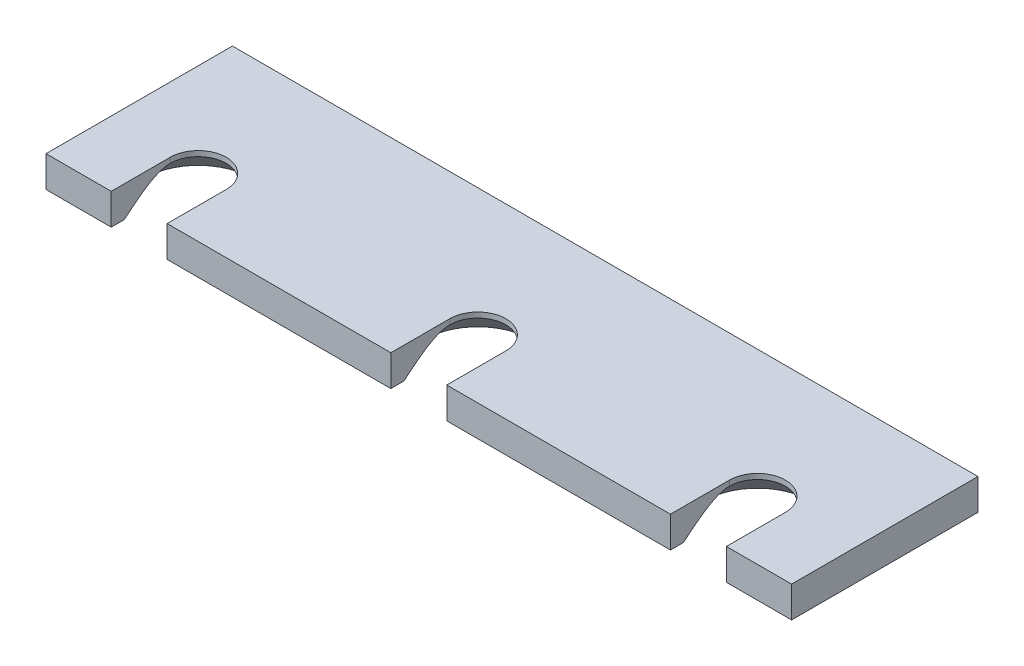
ISO-10303-21;
HEADER;
FILE_DESCRIPTION(('STEP AP214'),'2;1');
FILE_NAME('part.step','',(''),(''),'','','');
FILE_SCHEMA(('AUTOMOTIVE_DESIGN { 1 0 10303 214 1 1 1 1 }'));
ENDSEC;
DATA;
#1=APPLICATION_CONTEXT('core data for automotive mechanical design processes');
#2=APPLICATION_PROTOCOL_DEFINITION('international standard','automotive_design',2000,#1);
#3=PRODUCT_CONTEXT('',#1,'mechanical');
#4=PRODUCT('Part','Part','',(#3));
#5=PRODUCT_RELATED_PRODUCT_CATEGORY('part','',(#4));
#6=PRODUCT_DEFINITION_FORMATION('','',#4);
#7=PRODUCT_DEFINITION_CONTEXT('part definition',#1,'design');
#8=PRODUCT_DEFINITION('design','',#6,#7);
#9=PRODUCT_DEFINITION_SHAPE('','',#8);
#10=(LENGTH_UNIT() NAMED_UNIT(*) SI_UNIT(.MILLI.,.METRE.));
#11=(NAMED_UNIT(*) PLANE_ANGLE_UNIT() SI_UNIT($,.RADIAN.));
#12=(NAMED_UNIT(*) SI_UNIT($,.STERADIAN.) SOLID_ANGLE_UNIT());
#13=UNCERTAINTY_MEASURE_WITH_UNIT(LENGTH_MEASURE(1.E-05),#10,'distance_accuracy_value','');
#14=(GEOMETRIC_REPRESENTATION_CONTEXT(3) GLOBAL_UNCERTAINTY_ASSIGNED_CONTEXT((#13)) GLOBAL_UNIT_ASSIGNED_CONTEXT((#10,
#11,#12)) REPRESENTATION_CONTEXT('',''));
#15=CARTESIAN_POINT('',(0.,0.,0.));
#16=DIRECTION('',(0.,0.,1.));
#17=DIRECTION('',(1.,0.,0.));
#18=AXIS2_PLACEMENT_3D('',#15,#16,#17);
#19=CARTESIAN_POINT('',(60.,-5.00000000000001,15.));
#20=DIRECTION('',(0.,-1.,0.));
#21=DIRECTION('',(0.,0.,-1.));
#22=AXIS2_PLACEMENT_3D('',#19,#20,#21);
#23=PLANE('',#22);
#24=CARTESIAN_POINT('',(105.,-5.00000000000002,20.5));
#25=DIRECTION('',(0.,-1.,0.));
#26=DIRECTION('',(0.,0.,-1.));
#27=AXIS2_PLACEMENT_3D('',#24,#25,#26);
#28=CIRCLE('',#27,8.65000000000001);
#29=CARTESIAN_POINT('',(100.5,-5.00000000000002,27.8873202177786));
#30=VERTEX_POINT('',#29);
#31=CARTESIAN_POINT('',(109.5,-5.00000000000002,27.8873202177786));
#32=VERTEX_POINT('',#31);
#33=EDGE_CURVE('E165',#30,#32,#28,.T.);
#34=ORIENTED_EDGE('',*,*,#33,.F.);
#35=DIRECTION('',(0.,0.,-1.));
#36=VECTOR('',#35,1.);
#37=CARTESIAN_POINT('',(100.5,-5.00000000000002,25.25));
#38=LINE('',#37,#36);
#39=CARTESIAN_POINT('',(100.5,-5.00000000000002,30.));
#40=VERTEX_POINT('',#39);
#41=EDGE_CURVE('E339',#40,#30,#38,.T.);
#42=ORIENTED_EDGE('',*,*,#41,.F.);
#43=DIRECTION('',(-1.,0.,0.));
#44=VECTOR('',#43,1.);
#45=CARTESIAN_POINT('',(60.,-5.00000000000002,30.));
#46=LINE('',#45,#44);
#47=CARTESIAN_POINT('',(64.5,-5.00000000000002,30.));
#48=VERTEX_POINT('',#47);
#49=EDGE_CURVE('E262',#40,#48,#46,.T.);
#50=ORIENTED_EDGE('',*,*,#49,.T.);
#51=DIRECTION('',(0.,0.,1.));
#52=VECTOR('',#51,1.);
#53=CARTESIAN_POINT('',(64.5,-5.00000000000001,25.25));
#54=LINE('',#53,#52);
#55=CARTESIAN_POINT('',(64.5,-5.00000000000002,27.8873202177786));
#56=VERTEX_POINT('',#55);
#57=EDGE_CURVE('E260',#56,#48,#54,.T.);
#58=ORIENTED_EDGE('',*,*,#57,.F.);
#59=CARTESIAN_POINT('',(60.,-5.00000000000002,20.5));
#60=DIRECTION('',(0.,-1.,0.));
#61=DIRECTION('',(0.,0.,-1.));
#62=AXIS2_PLACEMENT_3D('',#59,#60,#61);
#63=CIRCLE('',#62,8.65000000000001);
#64=CARTESIAN_POINT('',(55.5,-5.00000000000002,27.8873202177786));
#65=VERTEX_POINT('',#64);
#66=EDGE_CURVE('E169',#65,#56,#63,.T.);
#67=ORIENTED_EDGE('',*,*,#66,.F.);
#68=DIRECTION('',(0.,0.,-1.));
#69=VECTOR('',#68,1.);
#70=CARTESIAN_POINT('',(55.5,-5.00000000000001,25.25));
#71=LINE('',#70,#69);
#72=CARTESIAN_POINT('',(55.5,-5.00000000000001,30.));
#73=VERTEX_POINT('',#72);
#74=EDGE_CURVE('E251',#73,#65,#71,.T.);
#75=ORIENTED_EDGE('',*,*,#74,.F.);
#76=DIRECTION('',(-1.,0.,0.));
#77=VECTOR('',#76,1.);
#78=CARTESIAN_POINT('',(60.,-5.00000000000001,30.));
#79=LINE('',#78,#77);
#80=CARTESIAN_POINT('',(19.5,-5.00000000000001,30.));
#81=VERTEX_POINT('',#80);
#82=EDGE_CURVE('E250',#73,#81,#79,.T.);
#83=ORIENTED_EDGE('',*,*,#82,.T.);
#84=DIRECTION('',(0.,0.,1.));
#85=VECTOR('',#84,1.);
#86=CARTESIAN_POINT('',(19.5,-5.00000000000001,25.25));
#87=LINE('',#86,#85);
#88=CARTESIAN_POINT('',(19.5,-5.00000000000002,27.8873202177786));
#89=VERTEX_POINT('',#88);
#90=EDGE_CURVE('E239',#89,#81,#87,.T.);
#91=ORIENTED_EDGE('',*,*,#90,.F.);
#92=CARTESIAN_POINT('',(15.,-5.00000000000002,20.5));
#93=DIRECTION('',(0.,-1.,0.));
#94=DIRECTION('',(0.,0.,-1.));
#95=AXIS2_PLACEMENT_3D('',#92,#93,#94);
#96=CIRCLE('',#95,8.65);
#97=CARTESIAN_POINT('',(10.5,-5.00000000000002,27.8873202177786));
#98=VERTEX_POINT('',#97);
#99=EDGE_CURVE('E375',#98,#89,#96,.T.);
#100=ORIENTED_EDGE('',*,*,#99,.F.);
#101=DIRECTION('',(0.,0.,-1.));
#102=VECTOR('',#101,1.);
#103=CARTESIAN_POINT('',(10.5,-5.,25.25));
#104=LINE('',#103,#102);
#105=CARTESIAN_POINT('',(10.5,-5.,30.));
#106=VERTEX_POINT('',#105);
#107=EDGE_CURVE('E230',#106,#98,#104,.T.);
#108=ORIENTED_EDGE('',*,*,#107,.F.);
#109=DIRECTION('',(-1.,0.,0.));
#110=VECTOR('',#109,1.);
#111=CARTESIAN_POINT('',(60.,-5.,30.));
#112=LINE('',#111,#110);
#113=CARTESIAN_POINT('',(0.,-5.,30.));
#114=VERTEX_POINT('',#113);
#115=EDGE_CURVE('E229',#106,#114,#112,.T.);
#116=ORIENTED_EDGE('',*,*,#115,.T.);
#117=DIRECTION('',(0.,0.,-1.));
#118=VECTOR('',#117,1.);
#119=CARTESIAN_POINT('',(0.,-5.,15.));
#120=LINE('',#119,#118);
#121=CARTESIAN_POINT('',(0.,-5.,0.));
#122=VERTEX_POINT('',#121);
#123=EDGE_CURVE('E222',#114,#122,#120,.T.);
#124=ORIENTED_EDGE('',*,*,#123,.T.);
#125=DIRECTION('',(1.,0.,0.));
#126=VECTOR('',#125,1.);
#127=CARTESIAN_POINT('',(60.,-5.,0.));
#128=LINE('',#127,#126);
#129=CARTESIAN_POINT('',(120.,-5.00000000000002,0.));
#130=VERTEX_POINT('',#129);
#131=EDGE_CURVE('E215',#122,#130,#128,.T.);
#132=ORIENTED_EDGE('',*,*,#131,.T.);
#133=DIRECTION('',(0.,0.,1.));
#134=VECTOR('',#133,1.);
#135=CARTESIAN_POINT('',(120.,-5.00000000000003,15.));
#136=LINE('',#135,#134);
#137=CARTESIAN_POINT('',(120.,-5.00000000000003,30.));
#138=VERTEX_POINT('',#137);
#139=EDGE_CURVE('E208',#130,#138,#136,.T.);
#140=ORIENTED_EDGE('',*,*,#139,.T.);
#141=DIRECTION('',(-1.,0.,0.));
#142=VECTOR('',#141,1.);
#143=CARTESIAN_POINT('',(60.,-5.00000000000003,30.));
#144=LINE('',#143,#142);
#145=CARTESIAN_POINT('',(109.5,-5.00000000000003,30.));
#146=VERTEX_POINT('',#145);
#147=EDGE_CURVE('E193',#138,#146,#144,.T.);
#148=ORIENTED_EDGE('',*,*,#147,.T.);
#149=DIRECTION('',(0.,0.,1.));
#150=VECTOR('',#149,1.);
#151=CARTESIAN_POINT('',(109.5,-5.00000000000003,25.25));
#152=LINE('',#151,#150);
#153=EDGE_CURVE('E187',#32,#146,#152,.T.);
#154=ORIENTED_EDGE('',*,*,#153,.F.);
#155=EDGE_LOOP('',(#34,#42,#50,#58,#67,#75,#83,#91,#100,#108,#116,#124,#132,#140,#148,#154));
#156=FACE_BOUND('',#155,.T.);
#157=ADVANCED_FACE('F30',(#156),#23,.T.);
#158=CARTESIAN_POINT('',(60.,-2.50000000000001,30.));
#159=DIRECTION('',(0.,0.,-1.));
#160=DIRECTION('',(-1.,0.,0.));
#161=AXIS2_PLACEMENT_3D('',#158,#159,#160);
#162=PLANE('',#161);
#163=DIRECTION('',(1.,0.,0.));
#164=VECTOR('',#163,1.);
#165=CARTESIAN_POINT('',(60.,0.,30.));
#166=LINE('',#165,#164);
#167=CARTESIAN_POINT('',(100.5,0.,30.));
#168=VERTEX_POINT('',#167);
#169=CARTESIAN_POINT('',(64.5,0.,30.));
#170=VERTEX_POINT('',#169);
#171=EDGE_CURVE('E191',#168,#170,#166,.F.);
#172=ORIENTED_EDGE('',*,*,#171,.T.);
#173=DIRECTION('',(0.,1.,0.));
#174=VECTOR('',#173,1.);
#175=CARTESIAN_POINT('',(64.5,-2.50000000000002,30.));
#176=LINE('',#175,#174);
#177=EDGE_CURVE('E259',#48,#170,#176,.T.);
#178=ORIENTED_EDGE('',*,*,#177,.F.);
#179=ORIENTED_EDGE('',*,*,#49,.F.);
#180=DIRECTION('',(0.,1.,0.));
#181=VECTOR('',#180,1.);
#182=CARTESIAN_POINT('',(100.5,-2.50000000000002,30.));
#183=LINE('',#182,#181);
#184=EDGE_CURVE('E185',#168,#40,#183,.F.);
#185=ORIENTED_EDGE('',*,*,#184,.F.);
#186=EDGE_LOOP('',(#172,#178,#179,#185));
#187=FACE_BOUND('',#186,.T.);
#188=ADVANCED_FACE('F381',(#187),#162,.F.);
#189=CARTESIAN_POINT('',(64.5,-2.50000000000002,25.25));
#190=DIRECTION('',(-1.,0.,0.));
#191=DIRECTION('',(0.,0.,1.));
#192=AXIS2_PLACEMENT_3D('',#189,#190,#191);
#193=PLANE('',#192);
#194=CARTESIAN_POINT('',(64.5,-9.28963943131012,32.631952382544));
#195=CARTESIAN_POINT('',(64.5,-9.02914938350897,32.3540918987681));
#196=CARTESIAN_POINT('',(64.5,-8.76920684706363,32.0757150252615));
#197=CARTESIAN_POINT('',(64.5,-8.25072788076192,31.5176296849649));
#198=CARTESIAN_POINT('',(64.5,-7.99219152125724,31.2379211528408));
#199=CARTESIAN_POINT('',(64.5,-7.47619973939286,30.6761803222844));
#200=CARTESIAN_POINT('',(64.5,-7.21874880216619,30.3941438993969));
#201=CARTESIAN_POINT('',(64.5,-6.7060771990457,29.8280630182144));
#202=CARTESIAN_POINT('',(64.5,-6.45085647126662,29.5440186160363));
#203=CARTESIAN_POINT('',(64.5,-5.91705178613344,28.9438858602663));
#204=CARTESIAN_POINT('',(64.5,-5.63877948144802,28.6275198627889));
#205=CARTESIAN_POINT('',(64.5,-5.08698000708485,27.9906748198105));
#206=CARTESIAN_POINT('',(64.5,-4.81345268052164,27.6701959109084));
#207=CARTESIAN_POINT('',(64.5,-4.40838766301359,27.1854620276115));
#208=CARTESIAN_POINT('',(64.5,-4.27432144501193,27.0233202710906));
#209=CARTESIAN_POINT('',(64.5,-4.00823214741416,26.6973706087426));
#210=CARTESIAN_POINT('',(64.5,-3.87620903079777,26.5335627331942));
#211=CARTESIAN_POINT('',(64.5,-3.61467406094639,26.2039933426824));
#212=CARTESIAN_POINT('',(64.5,-3.48516181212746,26.0382321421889));
#213=CARTESIAN_POINT('',(64.5,-3.22922450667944,25.7043478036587));
#214=CARTESIAN_POINT('',(64.5,-3.10279930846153,25.5362247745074));
#215=CARTESIAN_POINT('',(64.5,-2.87610002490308,25.2274628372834));
#216=CARTESIAN_POINT('',(64.5,-2.77519419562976,25.0872885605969));
#217=CARTESIAN_POINT('',(64.5,-2.5765730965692,24.8046862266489));
#218=CARTESIAN_POINT('',(64.5,-2.4788578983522,24.662258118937));
#219=CARTESIAN_POINT('',(64.5,-2.28720730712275,24.3745279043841));
#220=CARTESIAN_POINT('',(64.5,-2.19327845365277,24.2292214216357));
#221=CARTESIAN_POINT('',(64.5,-2.0103594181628,23.9355314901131));
#222=CARTESIAN_POINT('',(64.5,-1.92136904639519,23.7871481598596));
#223=CARTESIAN_POINT('',(64.5,-1.75146036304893,23.4900321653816));
#224=CARTESIAN_POINT('',(64.5,-1.67040896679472,23.3413766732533));
#225=CARTESIAN_POINT('',(64.5,-1.51584704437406,23.040218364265));
#226=CARTESIAN_POINT('',(64.5,-1.44233810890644,22.8877147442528));
#227=CARTESIAN_POINT('',(64.5,-1.23649826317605,22.4245930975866));
#228=CARTESIAN_POINT('',(64.5,-1.11813722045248,22.107171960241));
#229=CARTESIAN_POINT('',(64.5,-0.998404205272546,21.6701337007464));
#230=CARTESIAN_POINT('',(64.5,-0.971238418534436,21.5574461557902));
#231=CARTESIAN_POINT('',(64.5,-0.924637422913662,21.3304448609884));
#232=CARTESIAN_POINT('',(64.5,-0.905202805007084,21.2161309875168));
#233=CARTESIAN_POINT('',(64.5,-0.874820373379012,20.9867077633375));
#234=CARTESIAN_POINT('',(64.5,-0.863848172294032,20.871601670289));
#235=CARTESIAN_POINT('',(64.5,-0.850731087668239,20.6408817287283));
#236=CARTESIAN_POINT('',(64.5,-0.848586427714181,20.5252678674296));
#237=CARTESIAN_POINT('',(64.5,-0.853614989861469,20.2747214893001));
#238=CARTESIAN_POINT('',(64.5,-0.862420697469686,20.1398193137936));
#239=CARTESIAN_POINT('',(64.5,-0.891744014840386,19.8712931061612));
#240=CARTESIAN_POINT('',(64.5,-0.912263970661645,19.7376693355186));
#241=CARTESIAN_POINT('',(64.5,-0.96427172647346,19.4710155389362));
#242=CARTESIAN_POINT('',(64.5,-0.995882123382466,19.3380097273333));
#243=CARTESIAN_POINT('',(64.5,-1.06863152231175,19.0746913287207));
#244=CARTESIAN_POINT('',(64.5,-1.10976885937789,18.9443782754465));
#245=CARTESIAN_POINT('',(64.5,-1.20814173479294,18.6637689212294));
#246=CARTESIAN_POINT('',(64.5,-1.26693818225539,18.5140236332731));
#247=CARTESIAN_POINT('',(64.5,-1.39360059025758,18.218385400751));
#248=CARTESIAN_POINT('',(64.5,-1.46147087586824,18.0724943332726));
#249=CARTESIAN_POINT('',(64.5,-1.60468406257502,17.78385245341));
#250=CARTESIAN_POINT('',(64.5,-1.6800509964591,17.6411136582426));
#251=CARTESIAN_POINT('',(64.5,-1.83659102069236,17.3589076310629));
#252=CARTESIAN_POINT('',(64.5,-1.91776317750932,17.2194398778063));
#253=CARTESIAN_POINT('',(64.5,-2.08118110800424,16.9492963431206));
#254=CARTESIAN_POINT('',(64.5,-2.16322979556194,16.8185007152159));
#255=CARTESIAN_POINT('',(64.5,-2.33083360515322,16.5591681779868));
#256=CARTESIAN_POINT('',(64.5,-2.41638900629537,16.4306314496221));
#257=CARTESIAN_POINT('',(64.5,-2.58966592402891,16.176574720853));
#258=CARTESIAN_POINT('',(64.5,-2.67736393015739,16.0510386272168));
#259=CARTESIAN_POINT('',(64.5,-2.85511340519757,15.8016954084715));
#260=CARTESIAN_POINT('',(64.5,-2.94516420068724,15.6778878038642));
#261=CARTESIAN_POINT('',(64.5,-3.0361769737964,15.5548040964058));
#262=B_SPLINE_CURVE_WITH_KNOTS('',3,(#194,#195,#196,#197,#198,#199,#200,#201,#202,#203,#204,
#205,#206,#207,#208,#209,#210,#211,#212,#213,#214,#215,#216,#217,#218,#219,#220,#221,#222,#223,
#224,#225,#226,#227,#228,#229,#230,#231,#232,#233,#234,#235,#236,#237,#238,#239,#240,#241,#242,
#243,#244,#245,#246,#247,#248,#249,#250,#251,#252,#253,#254,#255,#256,#257,#258,#259,#260,#261),
.UNSPECIFIED.,.F.,.F.,(4,2,2,2,2,2,2,2,2,2,2,2,2,2,2,2,2,2,2,2,2,2,2,2,2,2,2,2,2,2,2,2,2,4),(0.,
1.14261090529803,2.28527845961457,3.43088244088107,4.57645453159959,5.84042824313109,
7.10436008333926,7.7355155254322,8.36665951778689,8.99770325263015,9.62871798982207,
10.1468301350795,10.6649538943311,11.1839372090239,11.7029005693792,12.2106238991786,
12.718454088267,13.7299570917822,14.0774921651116,14.4250537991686,14.7716100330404,
15.1181750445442,15.523189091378,15.928284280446,16.3380064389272,16.7476570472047,
17.229901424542,17.7123764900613,18.1964514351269,18.6804487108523,19.1435840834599,
19.6067563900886,20.0661312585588,20.5253760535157),.UNSPECIFIED.);
#263=CARTESIAN_POINT('',(64.5,-0.850000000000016,20.5));
#264=VERTEX_POINT('',#263);
#265=EDGE_CURVE('E370',#56,#264,#262,.T.);
#266=ORIENTED_EDGE('',*,*,#265,.F.);
#267=ORIENTED_EDGE('',*,*,#57,.T.);
#268=ORIENTED_EDGE('',*,*,#177,.T.);
#269=DIRECTION('',(0.,0.,-1.));
#270=VECTOR('',#269,1.);
#271=CARTESIAN_POINT('',(64.5,0.,15.));
#272=LINE('',#271,#270);
#273=CARTESIAN_POINT('',(64.5,0.,20.5));
#274=VERTEX_POINT('',#273);
#275=EDGE_CURVE('E287',#170,#274,#272,.T.);
#276=ORIENTED_EDGE('',*,*,#275,.T.);
#277=DIRECTION('',(0.,-1.,0.));
#278=VECTOR('',#277,1.);
#279=CARTESIAN_POINT('',(64.5,-2.50000000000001,20.5));
#280=LINE('',#279,#278);
#281=EDGE_CURVE('E256',#274,#264,#280,.T.);
#282=ORIENTED_EDGE('',*,*,#281,.T.);
#283=EDGE_LOOP('',(#266,#267,#268,#276,#282));
#284=FACE_BOUND('',#283,.T.);
#285=ADVANCED_FACE('F376',(#284),#193,.T.);
#286=CARTESIAN_POINT('',(60.,-2.50000000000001,20.5));
#287=DIRECTION('',(0.,-1.,0.));
#288=DIRECTION('',(1.,0.,0.));
#289=AXIS2_PLACEMENT_3D('',#286,#287,#288);
#290=CYLINDRICAL_SURFACE('',#289,4.5);
#291=DIRECTION('',(0.,1.,0.));
#292=VECTOR('',#291,1.);
#293=CARTESIAN_POINT('',(55.5,-2.50000000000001,20.5));
#294=LINE('',#293,#292);
#295=CARTESIAN_POINT('',(55.5,-0.850000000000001,20.5));
#296=VERTEX_POINT('',#295);
#297=CARTESIAN_POINT('',(55.5,0.,20.5));
#298=VERTEX_POINT('',#297);
#299=EDGE_CURVE('E254',#296,#298,#294,.T.);
#300=ORIENTED_EDGE('',*,*,#299,.F.);
#301=CARTESIAN_POINT('',(60.,-0.850000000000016,20.5));
#302=DIRECTION('',(0.,-1.,0.));
#303=DIRECTION('',(0.,0.,-1.));
#304=AXIS2_PLACEMENT_3D('',#301,#302,#303);
#305=CIRCLE('',#304,4.5);
#306=EDGE_CURVE('E56',#296,#264,#305,.T.);
#307=ORIENTED_EDGE('',*,*,#306,.T.);
#308=ORIENTED_EDGE('',*,*,#281,.F.);
#309=CARTESIAN_POINT('',(60.,0.,20.5));
#310=DIRECTION('',(0.,-1.,0.));
#311=DIRECTION('',(1.,0.,0.));
#312=AXIS2_PLACEMENT_3D('',#309,#310,#311);
#313=CIRCLE('',#312,4.5);
#314=EDGE_CURVE('E284',#274,#298,#313,.F.);
#315=ORIENTED_EDGE('',*,*,#314,.T.);
#316=EDGE_LOOP('',(#300,#307,#308,#315));
#317=FACE_BOUND('',#316,.T.);
#318=ADVANCED_FACE('F380',(#317),#290,.F.);
#319=CARTESIAN_POINT('',(55.5,-2.50000000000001,25.25));
#320=DIRECTION('',(1.,0.,0.));
#321=DIRECTION('',(0.,0.,-1.));
#322=AXIS2_PLACEMENT_3D('',#319,#320,#321);
#323=PLANE('',#322);
#324=CARTESIAN_POINT('',(55.5,-9.28963943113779,32.6319523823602));
#325=CARTESIAN_POINT('',(55.5,-9.0291493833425,32.35409189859));
#326=CARTESIAN_POINT('',(55.5,-8.76920684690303,32.0757150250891));
#327=CARTESIAN_POINT('',(55.5,-8.25072788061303,31.5176296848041));
#328=CARTESIAN_POINT('',(55.5,-7.99219152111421,31.2379211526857));
#329=CARTESIAN_POINT('',(55.5,-7.47619973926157,30.6761803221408));
#330=CARTESIAN_POINT('',(55.5,-7.21874880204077,30.3941438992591));
#331=CARTESIAN_POINT('',(55.5,-6.70607719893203,29.8280630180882));
#332=CARTESIAN_POINT('',(55.5,-6.45085647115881,29.5440186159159));
#333=CARTESIAN_POINT('',(55.5,-5.91705178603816,28.9438858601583));
#334=CARTESIAN_POINT('',(55.5,-5.6387794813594,28.6275198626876));
#335=CARTESIAN_POINT('',(55.5,-5.08698000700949,27.9906748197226));
#336=CARTESIAN_POINT('',(55.5,-4.81345268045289,27.6701959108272));
#337=CARTESIAN_POINT('',(55.5,-4.40838766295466,27.1854620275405));
#338=CARTESIAN_POINT('',(55.5,-4.27432144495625,27.023320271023));
#339=CARTESIAN_POINT('',(55.5,-4.00823214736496,26.6973706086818));
#340=CARTESIAN_POINT('',(55.5,-3.87620903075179,26.5335627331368));
#341=CARTESIAN_POINT('',(55.5,-3.61467406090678,26.203993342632));
#342=CARTESIAN_POINT('',(55.5,-3.48516181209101,26.038232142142));
#343=CARTESIAN_POINT('',(55.5,-3.22922450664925,25.7043478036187));
#344=CARTESIAN_POINT('',(55.5,-3.10279930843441,25.536224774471));
#345=CARTESIAN_POINT('',(55.5,-2.87610002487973,25.2274628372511));
#346=CARTESIAN_POINT('',(55.5,-2.77519419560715,25.0872885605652));
#347=CARTESIAN_POINT('',(55.5,-2.57657309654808,24.8046862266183));
#348=CARTESIAN_POINT('',(55.5,-2.47885789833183,24.662258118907));
#349=CARTESIAN_POINT('',(55.5,-2.28720730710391,24.3745279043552));
#350=CARTESIAN_POINT('',(55.5,-2.19327845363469,24.2292214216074));
#351=CARTESIAN_POINT('',(55.5,-2.01035941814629,23.9355314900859));
#352=CARTESIAN_POINT('',(55.5,-1.92136904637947,23.787148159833));
#353=CARTESIAN_POINT('',(55.5,-1.75146036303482,23.4900321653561));
#354=CARTESIAN_POINT('',(55.5,-1.67040896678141,23.3413766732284));
#355=CARTESIAN_POINT('',(55.5,-1.51584704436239,23.0402183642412));
#356=CARTESIAN_POINT('',(55.5,-1.44233810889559,22.8877147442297));
#357=CARTESIAN_POINT('',(55.5,-1.23649826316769,22.4245930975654));
#358=CARTESIAN_POINT('',(55.5,-1.11813722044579,22.107171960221));
#359=CARTESIAN_POINT('',(55.5,-0.998404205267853,21.6701337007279));
#360=CARTESIAN_POINT('',(55.5,-0.971238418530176,21.5574461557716));
#361=CARTESIAN_POINT('',(55.5,-0.924637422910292,21.33044486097));
#362=CARTESIAN_POINT('',(55.5,-0.905202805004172,21.2161309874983));
#363=CARTESIAN_POINT('',(55.5,-0.874820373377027,20.9867077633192));
#364=CARTESIAN_POINT('',(55.5,-0.863848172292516,20.8716016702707));
#365=CARTESIAN_POINT('',(55.5,-0.85073108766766,20.6408817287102));
#366=CARTESIAN_POINT('',(55.5,-0.848586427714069,20.5252678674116));
#367=CARTESIAN_POINT('',(55.5,-0.853614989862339,20.2747214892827));
#368=CARTESIAN_POINT('',(55.5,-0.86242069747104,20.1398193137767));
#369=CARTESIAN_POINT('',(55.5,-0.891744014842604,19.8712931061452));
#370=CARTESIAN_POINT('',(55.5,-0.912263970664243,19.7376693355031));
#371=CARTESIAN_POINT('',(55.5,-0.964271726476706,19.4710155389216));
#372=CARTESIAN_POINT('',(55.5,-0.995882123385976,19.3380097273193));
#373=CARTESIAN_POINT('',(55.5,-1.06863152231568,19.0746913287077));
#374=CARTESIAN_POINT('',(55.5,-1.10976885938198,18.944378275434));
#375=CARTESIAN_POINT('',(55.5,-1.20814173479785,18.6637689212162));
#376=CARTESIAN_POINT('',(55.5,-1.26693818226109,18.5140236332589));
#377=CARTESIAN_POINT('',(55.5,-1.39360059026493,18.2183854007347));
#378=CARTESIAN_POINT('',(55.5,-1.46147087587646,18.0724943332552));
#379=CARTESIAN_POINT('',(55.5,-1.60468406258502,17.7838524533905));
#380=CARTESIAN_POINT('',(55.5,-1.68005099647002,17.6411136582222));
#381=CARTESIAN_POINT('',(55.5,-1.83659102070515,17.3589076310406));
#382=CARTESIAN_POINT('',(55.5,-1.91776317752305,17.2194398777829));
#383=CARTESIAN_POINT('',(55.5,-2.08118110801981,16.9492963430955));
#384=CARTESIAN_POINT('',(55.5,-2.16322979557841,16.8185007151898));
#385=CARTESIAN_POINT('',(55.5,-2.33083360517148,16.5591681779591));
#386=CARTESIAN_POINT('',(55.5,-2.41638900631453,16.4306314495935));
#387=CARTESIAN_POINT('',(55.5,-2.58966592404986,16.1765747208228));
#388=CARTESIAN_POINT('',(55.5,-2.67736393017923,16.0510386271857));
#389=CARTESIAN_POINT('',(55.5,-2.85511340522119,15.8016954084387));
#390=CARTESIAN_POINT('',(55.5,-2.94516420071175,15.6778878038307));
#391=CARTESIAN_POINT('',(55.5,-3.0361769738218,15.5548040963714));
#392=B_SPLINE_CURVE_WITH_KNOTS('',3,(#324,#325,#326,#327,#328,#329,#330,#331,#332,#333,#334,
#335,#336,#337,#338,#339,#340,#341,#342,#343,#344,#345,#346,#347,#348,#349,#350,#351,#352,#353,
#354,#355,#356,#357,#358,#359,#360,#361,#362,#363,#364,#365,#366,#367,#368,#369,#370,#371,#372,
#373,#374,#375,#376,#377,#378,#379,#380,#381,#382,#383,#384,#385,#386,#387,#388,#389,#390,#391),
.UNSPECIFIED.,.F.,.F.,(4,2,2,2,2,2,2,2,2,2,2,2,2,2,2,2,2,2,2,2,2,2,2,2,2,2,2,2,2,2,2,2,2,4),(0.,
1.14261090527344,2.28527845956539,3.43088244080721,4.57645453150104,5.84042824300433,
7.1043600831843,7.73551552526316,8.36665951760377,8.99770325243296,9.62871798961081,
10.1468301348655,10.6649538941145,11.1839372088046,11.7029005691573,12.2106238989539,
12.7184540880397,13.7299570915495,14.0774921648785,14.4250537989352,14.7716100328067,
15.1181750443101,15.5231890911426,15.9282842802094,16.3380064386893,16.7476570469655,
17.2299014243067,17.7123764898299,18.1964514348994,18.6804487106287,19.14358408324,
19.6067563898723,20.066131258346,20.5253760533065),.UNSPECIFIED.);
#393=EDGE_CURVE('E42',#296,#65,#392,.F.);
#394=ORIENTED_EDGE('',*,*,#393,.F.);
#395=ORIENTED_EDGE('',*,*,#299,.T.);
#396=DIRECTION('',(0.,0.,-1.));
#397=VECTOR('',#396,1.);
#398=CARTESIAN_POINT('',(55.5,0.,15.));
#399=LINE('',#398,#397);
#400=CARTESIAN_POINT('',(55.5,0.,30.));
#401=VERTEX_POINT('',#400);
#402=EDGE_CURVE('E247',#298,#401,#399,.F.);
#403=ORIENTED_EDGE('',*,*,#402,.T.);
#404=DIRECTION('',(0.,1.,0.));
#405=VECTOR('',#404,1.);
#406=CARTESIAN_POINT('',(55.5,-2.50000000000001,30.));
#407=LINE('',#406,#405);
#408=EDGE_CURVE('E241',#401,#73,#407,.F.);
#409=ORIENTED_EDGE('',*,*,#408,.T.);
#410=ORIENTED_EDGE('',*,*,#74,.T.);
#411=EDGE_LOOP('',(#394,#395,#403,#409,#410));
#412=FACE_BOUND('',#411,.T.);
#413=ADVANCED_FACE('F442',(#412),#323,.T.);
#414=CARTESIAN_POINT('',(60.,-2.50000000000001,30.));
#415=DIRECTION('',(0.,0.,-1.));
#416=DIRECTION('',(-1.,0.,0.));
#417=AXIS2_PLACEMENT_3D('',#414,#415,#416);
#418=PLANE('',#417);
#419=DIRECTION('',(1.,0.,0.));
#420=VECTOR('',#419,1.);
#421=CARTESIAN_POINT('',(60.,0.,30.));
#422=LINE('',#421,#420);
#423=CARTESIAN_POINT('',(19.5,0.,30.));
#424=VERTEX_POINT('',#423);
#425=EDGE_CURVE('E243',#401,#424,#422,.F.);
#426=ORIENTED_EDGE('',*,*,#425,.T.);
#427=DIRECTION('',(0.,1.,0.));
#428=VECTOR('',#427,1.);
#429=CARTESIAN_POINT('',(19.5,-2.5,30.));
#430=LINE('',#429,#428);
#431=EDGE_CURVE('E238',#81,#424,#430,.T.);
#432=ORIENTED_EDGE('',*,*,#431,.F.);
#433=ORIENTED_EDGE('',*,*,#82,.F.);
#434=ORIENTED_EDGE('',*,*,#408,.F.);
#435=EDGE_LOOP('',(#426,#432,#433,#434));
#436=FACE_BOUND('',#435,.T.);
#437=ADVANCED_FACE('F318',(#436),#418,.F.);
#438=CARTESIAN_POINT('',(19.5,-2.5,25.25));
#439=DIRECTION('',(-1.,0.,0.));
#440=DIRECTION('',(0.,0.,1.));
#441=AXIS2_PLACEMENT_3D('',#438,#439,#440);
#442=PLANE('',#441);
#443=CARTESIAN_POINT('',(19.5,-9.28963943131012,32.631952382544));
#444=CARTESIAN_POINT('',(19.5,-9.02914938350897,32.3540918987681));
#445=CARTESIAN_POINT('',(19.5,-8.76920684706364,32.0757150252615));
#446=CARTESIAN_POINT('',(19.5,-8.25072788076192,31.5176296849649));
#447=CARTESIAN_POINT('',(19.5,-7.99219152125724,31.2379211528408));
#448=CARTESIAN_POINT('',(19.5,-7.47619973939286,30.6761803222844));
#449=CARTESIAN_POINT('',(19.5,-7.21874880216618,30.3941438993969));
#450=CARTESIAN_POINT('',(19.5,-6.7060771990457,29.8280630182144));
#451=CARTESIAN_POINT('',(19.5,-6.45085647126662,29.5440186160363));
#452=CARTESIAN_POINT('',(19.5,-5.91705178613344,28.9438858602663));
#453=CARTESIAN_POINT('',(19.5,-5.63877948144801,28.6275198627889));
#454=CARTESIAN_POINT('',(19.5,-5.08698000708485,27.9906748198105));
#455=CARTESIAN_POINT('',(19.5,-4.81345268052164,27.6701959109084));
#456=CARTESIAN_POINT('',(19.5,-4.40838766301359,27.1854620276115));
#457=CARTESIAN_POINT('',(19.5,-4.27432144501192,27.0233202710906));
#458=CARTESIAN_POINT('',(19.5,-4.00823214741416,26.6973706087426));
#459=CARTESIAN_POINT('',(19.5,-3.87620903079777,26.5335627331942));
#460=CARTESIAN_POINT('',(19.5,-3.61467406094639,26.2039933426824));
#461=CARTESIAN_POINT('',(19.5,-3.48516181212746,26.0382321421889));
#462=CARTESIAN_POINT('',(19.5,-3.22922450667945,25.7043478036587));
#463=CARTESIAN_POINT('',(19.5,-3.10279930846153,25.5362247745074));
#464=CARTESIAN_POINT('',(19.5,-2.87610002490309,25.2274628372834));
#465=CARTESIAN_POINT('',(19.5,-2.77519419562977,25.0872885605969));
#466=CARTESIAN_POINT('',(19.5,-2.57657309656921,24.8046862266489));
#467=CARTESIAN_POINT('',(19.5,-2.4788578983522,24.662258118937));
#468=CARTESIAN_POINT('',(19.5,-2.28720730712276,24.3745279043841));
#469=CARTESIAN_POINT('',(19.5,-2.19327845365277,24.2292214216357));
#470=CARTESIAN_POINT('',(19.5,-2.0103594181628,23.9355314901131));
#471=CARTESIAN_POINT('',(19.5,-1.92136904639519,23.7871481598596));
#472=CARTESIAN_POINT('',(19.5,-1.75146036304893,23.4900321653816));
#473=CARTESIAN_POINT('',(19.5,-1.67040896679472,23.3413766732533));
#474=CARTESIAN_POINT('',(19.5,-1.51584704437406,23.040218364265));
#475=CARTESIAN_POINT('',(19.5,-1.44233810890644,22.8877147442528));
#476=CARTESIAN_POINT('',(19.5,-1.23649826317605,22.4245930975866));
#477=CARTESIAN_POINT('',(19.5,-1.11813722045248,22.107171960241));
#478=CARTESIAN_POINT('',(19.5,-0.998404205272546,21.6701337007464));
#479=CARTESIAN_POINT('',(19.5,-0.971238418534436,21.5574461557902));
#480=CARTESIAN_POINT('',(19.5,-0.924637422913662,21.3304448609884));
#481=CARTESIAN_POINT('',(19.5,-0.905202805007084,21.2161309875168));
#482=CARTESIAN_POINT('',(19.5,-0.874820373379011,20.9867077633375));
#483=CARTESIAN_POINT('',(19.5,-0.863848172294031,20.871601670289));
#484=CARTESIAN_POINT('',(19.5,-0.850731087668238,20.6408817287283));
#485=CARTESIAN_POINT('',(19.5,-0.84858642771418,20.5252678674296));
#486=CARTESIAN_POINT('',(19.5,-0.853614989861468,20.2747214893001));
#487=CARTESIAN_POINT('',(19.5,-0.862420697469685,20.1398193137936));
#488=CARTESIAN_POINT('',(19.5,-0.891744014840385,19.8712931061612));
#489=CARTESIAN_POINT('',(19.5,-0.912263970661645,19.7376693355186));
#490=CARTESIAN_POINT('',(19.5,-0.96427172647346,19.4710155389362));
#491=CARTESIAN_POINT('',(19.5,-0.995882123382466,19.3380097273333));
#492=CARTESIAN_POINT('',(19.5,-1.06863152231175,19.0746913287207));
#493=CARTESIAN_POINT('',(19.5,-1.10976885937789,18.9443782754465));
#494=CARTESIAN_POINT('',(19.5,-1.20814173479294,18.6637689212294));
#495=CARTESIAN_POINT('',(19.5,-1.26693818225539,18.5140236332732));
#496=CARTESIAN_POINT('',(19.5,-1.39360059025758,18.218385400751));
#497=CARTESIAN_POINT('',(19.5,-1.46147087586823,18.0724943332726));
#498=CARTESIAN_POINT('',(19.5,-1.60468406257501,17.78385245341));
#499=CARTESIAN_POINT('',(19.5,-1.68005099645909,17.6411136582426));
#500=CARTESIAN_POINT('',(19.5,-1.83659102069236,17.3589076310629));
#501=CARTESIAN_POINT('',(19.5,-1.91776317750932,17.2194398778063));
#502=CARTESIAN_POINT('',(19.5,-2.08118110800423,16.9492963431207));
#503=CARTESIAN_POINT('',(19.5,-2.16322979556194,16.8185007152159));
#504=CARTESIAN_POINT('',(19.5,-2.33083360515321,16.5591681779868));
#505=CARTESIAN_POINT('',(19.5,-2.41638900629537,16.4306314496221));
#506=CARTESIAN_POINT('',(19.5,-2.5896659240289,16.176574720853));
#507=CARTESIAN_POINT('',(19.5,-2.67736393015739,16.0510386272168));
#508=CARTESIAN_POINT('',(19.5,-2.85511340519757,15.8016954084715));
#509=CARTESIAN_POINT('',(19.5,-2.94516420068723,15.6778878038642));
#510=CARTESIAN_POINT('',(19.5,-3.03617697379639,15.5548040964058));
#511=B_SPLINE_CURVE_WITH_KNOTS('',3,(#443,#444,#445,#446,#447,#448,#449,#450,#451,#452,#453,
#454,#455,#456,#457,#458,#459,#460,#461,#462,#463,#464,#465,#466,#467,#468,#469,#470,#471,#472,
#473,#474,#475,#476,#477,#478,#479,#480,#481,#482,#483,#484,#485,#486,#487,#488,#489,#490,#491,
#492,#493,#494,#495,#496,#497,#498,#499,#500,#501,#502,#503,#504,#505,#506,#507,#508,#509,#510),
.UNSPECIFIED.,.F.,.F.,(4,2,2,2,2,2,2,2,2,2,2,2,2,2,2,2,2,2,2,2,2,2,2,2,2,2,2,2,2,2,2,2,2,4),(0.,
1.14261090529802,2.28527845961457,3.43088244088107,4.57645453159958,5.84042824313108,
7.10436008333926,7.73551552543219,8.36665951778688,8.99770325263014,9.62871798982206,
10.1468301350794,10.6649538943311,11.1839372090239,11.7029005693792,12.2106238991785,
12.718454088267,13.7299570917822,14.0774921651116,14.4250537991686,14.7716100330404,
15.1181750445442,15.523189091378,15.928284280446,16.3380064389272,16.7476570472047,
17.229901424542,17.7123764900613,18.1964514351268,18.6804487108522,19.1435840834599,
19.6067563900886,20.0661312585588,20.5253760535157),.UNSPECIFIED.);
#512=CARTESIAN_POINT('',(19.5,-0.850000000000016,20.5));
#513=VERTEX_POINT('',#512);
#514=EDGE_CURVE('E266',#89,#513,#511,.T.);
#515=ORIENTED_EDGE('',*,*,#514,.F.);
#516=ORIENTED_EDGE('',*,*,#90,.T.);
#517=ORIENTED_EDGE('',*,*,#431,.T.);
#518=DIRECTION('',(0.,0.,-1.));
#519=VECTOR('',#518,1.);
#520=CARTESIAN_POINT('',(19.5,0.,15.));
#521=LINE('',#520,#519);
#522=CARTESIAN_POINT('',(19.5,0.,20.5));
#523=VERTEX_POINT('',#522);
#524=EDGE_CURVE('E246',#424,#523,#521,.T.);
#525=ORIENTED_EDGE('',*,*,#524,.T.);
#526=DIRECTION('',(0.,-1.,0.));
#527=VECTOR('',#526,1.);
#528=CARTESIAN_POINT('',(19.5,-2.5,20.5));
#529=LINE('',#528,#527);
#530=EDGE_CURVE('E235',#523,#513,#529,.T.);
#531=ORIENTED_EDGE('',*,*,#530,.T.);
#532=EDGE_LOOP('',(#515,#516,#517,#525,#531));
#533=FACE_BOUND('',#532,.T.);
#534=ADVANCED_FACE('F313',(#533),#442,.T.);
#535=CARTESIAN_POINT('',(15.,-2.5,20.5));
#536=DIRECTION('',(0.,-1.,0.));
#537=DIRECTION('',(1.,0.,0.));
#538=AXIS2_PLACEMENT_3D('',#535,#536,#537);
#539=CYLINDRICAL_SURFACE('',#538,4.5);
#540=DIRECTION('',(0.,1.,0.));
#541=VECTOR('',#540,1.);
#542=CARTESIAN_POINT('',(10.5,-2.5,20.5));
#543=LINE('',#542,#541);
#544=CARTESIAN_POINT('',(10.5,-0.850000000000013,20.5));
#545=VERTEX_POINT('',#544);
#546=CARTESIAN_POINT('',(10.5,0.,20.5));
#547=VERTEX_POINT('',#546);
#548=EDGE_CURVE('E233',#545,#547,#543,.T.);
#549=ORIENTED_EDGE('',*,*,#548,.F.);
#550=CARTESIAN_POINT('',(15.,-0.850000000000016,20.5));
#551=DIRECTION('',(0.,-1.,0.));
#552=DIRECTION('',(0.,0.,-1.));
#553=AXIS2_PLACEMENT_3D('',#550,#551,#552);
#554=CIRCLE('',#553,4.5);
#555=EDGE_CURVE('E326',#545,#513,#554,.T.);
#556=ORIENTED_EDGE('',*,*,#555,.T.);
#557=ORIENTED_EDGE('',*,*,#530,.F.);
#558=CARTESIAN_POINT('',(15.,0.,20.5));
#559=DIRECTION('',(0.,-1.,0.));
#560=DIRECTION('',(1.,0.,0.));
#561=AXIS2_PLACEMENT_3D('',#558,#559,#560);
#562=CIRCLE('',#561,4.5);
#563=EDGE_CURVE('E281',#523,#547,#562,.F.);
#564=ORIENTED_EDGE('',*,*,#563,.T.);
#565=EDGE_LOOP('',(#549,#556,#557,#564));
#566=FACE_BOUND('',#565,.T.);
#567=ADVANCED_FACE('F308',(#566),#539,.F.);
#568=CARTESIAN_POINT('',(10.5,-2.5,25.25));
#569=DIRECTION('',(1.,0.,0.));
#570=DIRECTION('',(0.,0.,-1.));
#571=AXIS2_PLACEMENT_3D('',#568,#569,#570);
#572=PLANE('',#571);
#573=CARTESIAN_POINT('',(10.5,-9.28963943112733,32.631952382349));
#574=CARTESIAN_POINT('',(10.5,-9.02914938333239,32.3540918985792));
#575=CARTESIAN_POINT('',(10.5,-8.76920684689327,32.0757150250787));
#576=CARTESIAN_POINT('',(10.5,-8.25072788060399,31.5176296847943));
#577=CARTESIAN_POINT('',(10.5,-7.99219152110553,31.2379211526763));
#578=CARTESIAN_POINT('',(10.5,-7.47619973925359,30.6761803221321));
#579=CARTESIAN_POINT('',(10.5,-7.21874880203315,30.3941438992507));
#580=CARTESIAN_POINT('',(10.5,-6.70607719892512,29.8280630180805));
#581=CARTESIAN_POINT('',(10.5,-6.45085647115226,29.5440186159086));
#582=CARTESIAN_POINT('',(10.5,-5.91705178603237,28.9438858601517));
#583=CARTESIAN_POINT('',(10.5,-5.63877948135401,28.6275198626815));
#584=CARTESIAN_POINT('',(10.5,-5.08698000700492,27.9906748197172));
#585=CARTESIAN_POINT('',(10.5,-4.81345268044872,27.6701959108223));
#586=CARTESIAN_POINT('',(10.5,-4.40838766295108,27.1854620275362));
#587=CARTESIAN_POINT('',(10.5,-4.27432144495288,27.0233202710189));
#588=CARTESIAN_POINT('',(10.5,-4.00823214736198,26.697370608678));
#589=CARTESIAN_POINT('',(10.5,-3.876209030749,26.5335627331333));
#590=CARTESIAN_POINT('',(10.5,-3.61467406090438,26.2039933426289));
#591=CARTESIAN_POINT('',(10.5,-3.4851618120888,26.0382321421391));
#592=CARTESIAN_POINT('',(10.5,-3.22922450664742,25.7043478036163));
#593=CARTESIAN_POINT('',(10.5,-3.10279930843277,25.5362247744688));
#594=CARTESIAN_POINT('',(10.5,-2.87610002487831,25.2274628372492));
#595=CARTESIAN_POINT('',(10.5,-2.77519419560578,25.0872885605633));
#596=CARTESIAN_POINT('',(10.5,-2.5765730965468,24.8046862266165));
#597=CARTESIAN_POINT('',(10.5,-2.47885789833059,24.6622581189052));
#598=CARTESIAN_POINT('',(10.5,-2.28720730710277,24.3745279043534));
#599=CARTESIAN_POINT('',(10.5,-2.19327845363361,24.2292214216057));
#600=CARTESIAN_POINT('',(10.5,-2.0103594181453,23.9355314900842));
#601=CARTESIAN_POINT('',(10.5,-1.92136904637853,23.7871481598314));
#602=CARTESIAN_POINT('',(10.5,-1.75146036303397,23.4900321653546));
#603=CARTESIAN_POINT('',(10.5,-1.67040896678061,23.3413766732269));
#604=CARTESIAN_POINT('',(10.5,-1.51584704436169,23.0402183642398));
#605=CARTESIAN_POINT('',(10.5,-1.44233810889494,22.8877147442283));
#606=CARTESIAN_POINT('',(10.5,-1.23649826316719,22.4245930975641));
#607=CARTESIAN_POINT('',(10.5,-1.11813722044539,22.1071719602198));
#608=CARTESIAN_POINT('',(10.5,-0.998404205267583,21.6701337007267));
#609=CARTESIAN_POINT('',(10.5,-0.971238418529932,21.5574461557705));
#610=CARTESIAN_POINT('',(10.5,-0.924637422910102,21.3304448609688));
#611=CARTESIAN_POINT('',(10.5,-0.905202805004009,21.2161309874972));
#612=CARTESIAN_POINT('',(10.5,-0.87482037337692,20.9867077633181));
#613=CARTESIAN_POINT('',(10.5,-0.863848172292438,20.8716016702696));
#614=CARTESIAN_POINT('',(10.5,-0.850731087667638,20.6408817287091));
#615=CARTESIAN_POINT('',(10.5,-0.848586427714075,20.5252678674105));
#616=CARTESIAN_POINT('',(10.5,-0.853614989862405,20.2747214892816));
#617=CARTESIAN_POINT('',(10.5,-0.862420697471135,20.1398193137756));
#618=CARTESIAN_POINT('',(10.5,-0.891744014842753,19.8712931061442));
#619=CARTESIAN_POINT('',(10.5,-0.912263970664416,19.7376693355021));
#620=CARTESIAN_POINT('',(10.5,-0.964271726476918,19.4710155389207));
#621=CARTESIAN_POINT('',(10.5,-0.995882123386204,19.3380097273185));
#622=CARTESIAN_POINT('',(10.5,-1.06863152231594,19.0746913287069));
#623=CARTESIAN_POINT('',(10.5,-1.10976885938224,18.9443782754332));
#624=CARTESIAN_POINT('',(10.5,-1.20814173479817,18.6637689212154));
#625=CARTESIAN_POINT('',(10.5,-1.26693818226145,18.5140236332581));
#626=CARTESIAN_POINT('',(10.5,-1.3936005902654,18.2183854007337));
#627=CARTESIAN_POINT('',(10.5,-1.46147087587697,18.0724943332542));
#628=CARTESIAN_POINT('',(10.5,-1.60468406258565,17.7838524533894));
#629=CARTESIAN_POINT('',(10.5,-1.6800509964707,17.6411136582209));
#630=CARTESIAN_POINT('',(10.5,-1.83659102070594,17.3589076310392));
#631=CARTESIAN_POINT('',(10.5,-1.9177631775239,17.2194398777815));
#632=CARTESIAN_POINT('',(10.5,-2.08118110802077,16.9492963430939));
#633=CARTESIAN_POINT('',(10.5,-2.16322979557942,16.8185007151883));
#634=CARTESIAN_POINT('',(10.5,-2.3308336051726,16.5591681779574));
#635=CARTESIAN_POINT('',(10.5,-2.41638900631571,16.4306314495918));
#636=CARTESIAN_POINT('',(10.5,-2.58966592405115,16.1765747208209));
#637=CARTESIAN_POINT('',(10.5,-2.67736393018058,16.0510386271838));
#638=CARTESIAN_POINT('',(10.5,-2.85511340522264,15.8016954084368));
#639=CARTESIAN_POINT('',(10.5,-2.94516420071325,15.6778878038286));
#640=CARTESIAN_POINT('',(10.5,-3.03617697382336,15.5548040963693));
#641=B_SPLINE_CURVE_WITH_KNOTS('',3,(#573,#574,#575,#576,#577,#578,#579,#580,#581,#582,#583,
#584,#585,#586,#587,#588,#589,#590,#591,#592,#593,#594,#595,#596,#597,#598,#599,#600,#601,#602,
#603,#604,#605,#606,#607,#608,#609,#610,#611,#612,#613,#614,#615,#616,#617,#618,#619,#620,#621,
#622,#623,#624,#625,#626,#627,#628,#629,#630,#631,#632,#633,#634,#635,#636,#637,#638,#639,#640),
.UNSPECIFIED.,.F.,.F.,(4,2,2,2,2,2,2,2,2,2,2,2,2,2,2,2,2,2,2,2,2,2,2,2,2,2,2,2,2,2,2,2,2,4),(0.,
1.14261090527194,2.2852784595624,3.43088244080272,4.57645453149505,5.84042824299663,
7.10436008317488,7.73551552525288,8.36665951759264,8.99770325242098,9.62871798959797,
10.1468301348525,10.6649538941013,11.1839372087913,11.7029005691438,12.2106238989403,
12.7184540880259,13.7299570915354,14.0774921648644,14.425053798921,14.7716100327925,
15.1181750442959,15.5231890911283,15.928284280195,16.3380064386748,16.7476570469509,
17.2299014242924,17.7123764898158,18.1964514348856,18.6804487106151,19.1435840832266,
19.6067563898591,20.0661312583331,20.5253760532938),.UNSPECIFIED.);
#642=EDGE_CURVE('E288',#545,#98,#641,.F.);
#643=ORIENTED_EDGE('',*,*,#642,.F.);
#644=ORIENTED_EDGE('',*,*,#548,.T.);
#645=DIRECTION('',(0.,0.,-1.));
#646=VECTOR('',#645,1.);
#647=CARTESIAN_POINT('',(10.5,0.,15.));
#648=LINE('',#647,#646);
#649=CARTESIAN_POINT('',(10.5,0.,30.));
#650=VERTEX_POINT('',#649);
#651=EDGE_CURVE('E225',#547,#650,#648,.F.);
#652=ORIENTED_EDGE('',*,*,#651,.T.);
#653=DIRECTION('',(0.,1.,0.));
#654=VECTOR('',#653,1.);
#655=CARTESIAN_POINT('',(10.5,-2.50000000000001,30.));
#656=LINE('',#655,#654);
#657=EDGE_CURVE('E226',#650,#106,#656,.F.);
#658=ORIENTED_EDGE('',*,*,#657,.T.);
#659=ORIENTED_EDGE('',*,*,#107,.T.);
#660=EDGE_LOOP('',(#643,#644,#652,#658,#659));
#661=FACE_BOUND('',#660,.T.);
#662=ADVANCED_FACE('F302',(#661),#572,.T.);
#663=CARTESIAN_POINT('',(60.,-2.50000000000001,30.));
#664=DIRECTION('',(0.,0.,-1.));
#665=DIRECTION('',(-1.,0.,0.));
#666=AXIS2_PLACEMENT_3D('',#663,#664,#665);
#667=PLANE('',#666);
#668=DIRECTION('',(1.,0.,0.));
#669=VECTOR('',#668,1.);
#670=CARTESIAN_POINT('',(60.,0.,30.));
#671=LINE('',#670,#669);
#672=CARTESIAN_POINT('',(0.,0.,30.));
#673=VERTEX_POINT('',#672);
#674=EDGE_CURVE('E218',#650,#673,#671,.F.);
#675=ORIENTED_EDGE('',*,*,#674,.T.);
#676=DIRECTION('',(0.,1.,0.));
#677=VECTOR('',#676,1.);
#678=CARTESIAN_POINT('',(0.,-2.5,30.));
#679=LINE('',#678,#677);
#680=EDGE_CURVE('E219',#673,#114,#679,.F.);
#681=ORIENTED_EDGE('',*,*,#680,.T.);
#682=ORIENTED_EDGE('',*,*,#115,.F.);
#683=ORIENTED_EDGE('',*,*,#657,.F.);
#684=EDGE_LOOP('',(#675,#681,#682,#683));
#685=FACE_BOUND('',#684,.T.);
#686=ADVANCED_FACE('F307',(#685),#667,.F.);
#687=CARTESIAN_POINT('',(0.,-2.5,15.));
#688=DIRECTION('',(1.,0.,0.));
#689=DIRECTION('',(0.,0.,-1.));
#690=AXIS2_PLACEMENT_3D('',#687,#688,#689);
#691=PLANE('',#690);
#692=DIRECTION('',(0.,0.,-1.));
#693=VECTOR('',#692,1.);
#694=CARTESIAN_POINT('',(0.,0.,15.));
#695=LINE('',#694,#693);
#696=CARTESIAN_POINT('',(0.,0.,0.));
#697=VERTEX_POINT('',#696);
#698=EDGE_CURVE('E211',#673,#697,#695,.T.);
#699=ORIENTED_EDGE('',*,*,#698,.T.);
#700=DIRECTION('',(0.,1.,0.));
#701=VECTOR('',#700,1.);
#702=CARTESIAN_POINT('',(0.,-2.50000000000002,0.));
#703=LINE('',#702,#701);
#704=EDGE_CURVE('E212',#697,#122,#703,.F.);
#705=ORIENTED_EDGE('',*,*,#704,.T.);
#706=ORIENTED_EDGE('',*,*,#123,.F.);
#707=ORIENTED_EDGE('',*,*,#680,.F.);
#708=EDGE_LOOP('',(#699,#705,#706,#707));
#709=FACE_BOUND('',#708,.T.);
#710=ADVANCED_FACE('F415',(#709),#691,.F.);
#711=CARTESIAN_POINT('',(60.,-2.50000000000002,0.));
#712=DIRECTION('',(0.,0.,1.));
#713=DIRECTION('',(1.,0.,0.));
#714=AXIS2_PLACEMENT_3D('',#711,#712,#713);
#715=PLANE('',#714);
#716=DIRECTION('',(1.,0.,0.));
#717=VECTOR('',#716,1.);
#718=CARTESIAN_POINT('',(60.,0.,0.));
#719=LINE('',#718,#717);
#720=CARTESIAN_POINT('',(120.,0.,0.));
#721=VERTEX_POINT('',#720);
#722=EDGE_CURVE('E205',#697,#721,#719,.T.);
#723=ORIENTED_EDGE('',*,*,#722,.T.);
#724=DIRECTION('',(0.,1.,0.));
#725=VECTOR('',#724,1.);
#726=CARTESIAN_POINT('',(120.,-2.50000000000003,0.));
#727=LINE('',#726,#725);
#728=EDGE_CURVE('E202',#721,#130,#727,.F.);
#729=ORIENTED_EDGE('',*,*,#728,.T.);
#730=ORIENTED_EDGE('',*,*,#131,.F.);
#731=ORIENTED_EDGE('',*,*,#704,.F.);
#732=EDGE_LOOP('',(#723,#729,#730,#731));
#733=FACE_BOUND('',#732,.T.);
#734=ADVANCED_FACE('F409',(#733),#715,.F.);
#735=CARTESIAN_POINT('',(120.,-2.50000000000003,15.));
#736=DIRECTION('',(-1.,0.,0.));
#737=DIRECTION('',(0.,0.,1.));
#738=AXIS2_PLACEMENT_3D('',#735,#736,#737);
#739=PLANE('',#738);
#740=DIRECTION('',(0.,0.,-1.));
#741=VECTOR('',#740,1.);
#742=CARTESIAN_POINT('',(120.,0.,15.));
#743=LINE('',#742,#741);
#744=CARTESIAN_POINT('',(120.,0.,30.));
#745=VERTEX_POINT('',#744);
#746=EDGE_CURVE('E198',#721,#745,#743,.F.);
#747=ORIENTED_EDGE('',*,*,#746,.T.);
#748=DIRECTION('',(0.,1.,0.));
#749=VECTOR('',#748,1.);
#750=CARTESIAN_POINT('',(120.,-2.50000000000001,30.));
#751=LINE('',#750,#749);
#752=EDGE_CURVE('E199',#745,#138,#751,.F.);
#753=ORIENTED_EDGE('',*,*,#752,.T.);
#754=ORIENTED_EDGE('',*,*,#139,.F.);
#755=ORIENTED_EDGE('',*,*,#728,.F.);
#756=EDGE_LOOP('',(#747,#753,#754,#755));
#757=FACE_BOUND('',#756,.T.);
#758=ADVANCED_FACE('F404',(#757),#739,.F.);
#759=CARTESIAN_POINT('',(60.,-2.50000000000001,30.));
#760=DIRECTION('',(0.,0.,-1.));
#761=DIRECTION('',(-1.,0.,0.));
#762=AXIS2_PLACEMENT_3D('',#759,#760,#761);
#763=PLANE('',#762);
#764=ORIENTED_EDGE('',*,*,#147,.F.);
#765=ORIENTED_EDGE('',*,*,#752,.F.);
#766=DIRECTION('',(1.,0.,0.));
#767=VECTOR('',#766,1.);
#768=CARTESIAN_POINT('',(60.,0.,30.));
#769=LINE('',#768,#767);
#770=CARTESIAN_POINT('',(109.5,0.,30.));
#771=VERTEX_POINT('',#770);
#772=EDGE_CURVE('E195',#745,#771,#769,.F.);
#773=ORIENTED_EDGE('',*,*,#772,.T.);
#774=DIRECTION('',(0.,1.,0.));
#775=VECTOR('',#774,1.);
#776=CARTESIAN_POINT('',(109.5,-2.50000000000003,30.));
#777=LINE('',#776,#775);
#778=EDGE_CURVE('E183',#146,#771,#777,.T.);
#779=ORIENTED_EDGE('',*,*,#778,.F.);
#780=EDGE_LOOP('',(#764,#765,#773,#779));
#781=FACE_BOUND('',#780,.T.);
#782=ADVANCED_FACE('F400',(#781),#763,.F.);
#783=CARTESIAN_POINT('',(109.5,-2.50000000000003,25.25));
#784=DIRECTION('',(-1.,0.,0.));
#785=DIRECTION('',(0.,0.,1.));
#786=AXIS2_PLACEMENT_3D('',#783,#784,#785);
#787=PLANE('',#786);
#788=CARTESIAN_POINT('',(109.5,-9.28963943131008,32.631952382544));
#789=CARTESIAN_POINT('',(109.5,-9.02914938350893,32.3540918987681));
#790=CARTESIAN_POINT('',(109.5,-8.7692068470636,32.0757150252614));
#791=CARTESIAN_POINT('',(109.5,-8.25072788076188,31.5176296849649));
#792=CARTESIAN_POINT('',(109.5,-7.99219152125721,31.2379211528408));
#793=CARTESIAN_POINT('',(109.5,-7.47619973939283,30.6761803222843));
#794=CARTESIAN_POINT('',(109.5,-7.21874880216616,30.3941438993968));
#795=CARTESIAN_POINT('',(109.5,-6.70607719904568,29.8280630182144));
#796=CARTESIAN_POINT('',(109.5,-6.4508564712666,29.5440186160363));
#797=CARTESIAN_POINT('',(109.5,-5.91705178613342,28.9438858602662));
#798=CARTESIAN_POINT('',(109.5,-5.638779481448,28.6275198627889));
#799=CARTESIAN_POINT('',(109.5,-5.08698000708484,27.9906748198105));
#800=CARTESIAN_POINT('',(109.5,-4.81345268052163,27.6701959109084));
#801=CARTESIAN_POINT('',(109.5,-4.40838766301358,27.1854620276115));
#802=CARTESIAN_POINT('',(109.5,-4.27432144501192,27.0233202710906));
#803=CARTESIAN_POINT('',(109.5,-4.00823214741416,26.6973706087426));
#804=CARTESIAN_POINT('',(109.5,-3.87620903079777,26.5335627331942));
#805=CARTESIAN_POINT('',(109.5,-3.61467406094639,26.2039933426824));
#806=CARTESIAN_POINT('',(109.5,-3.48516181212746,26.0382321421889));
#807=CARTESIAN_POINT('',(109.5,-3.22922450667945,25.7043478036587));
#808=CARTESIAN_POINT('',(109.5,-3.10279930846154,25.5362247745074));
#809=CARTESIAN_POINT('',(109.5,-2.8761000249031,25.2274628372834));
#810=CARTESIAN_POINT('',(109.5,-2.77519419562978,25.0872885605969));
#811=CARTESIAN_POINT('',(109.5,-2.57657309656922,24.8046862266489));
#812=CARTESIAN_POINT('',(109.5,-2.47885789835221,24.662258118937));
#813=CARTESIAN_POINT('',(109.5,-2.28720730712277,24.3745279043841));
#814=CARTESIAN_POINT('',(109.5,-2.19327845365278,24.2292214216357));
#815=CARTESIAN_POINT('',(109.5,-2.01035941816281,23.9355314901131));
#816=CARTESIAN_POINT('',(109.5,-1.9213690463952,23.7871481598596));
#817=CARTESIAN_POINT('',(109.5,-1.75146036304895,23.4900321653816));
#818=CARTESIAN_POINT('',(109.5,-1.67040896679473,23.3413766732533));
#819=CARTESIAN_POINT('',(109.5,-1.51584704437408,23.040218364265));
#820=CARTESIAN_POINT('',(109.5,-1.44233810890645,22.8877147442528));
#821=CARTESIAN_POINT('',(109.5,-1.23649826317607,22.4245930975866));
#822=CARTESIAN_POINT('',(109.5,-1.11813722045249,22.107171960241));
#823=CARTESIAN_POINT('',(109.5,-0.998404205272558,21.6701337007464));
#824=CARTESIAN_POINT('',(109.5,-0.971238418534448,21.5574461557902));
#825=CARTESIAN_POINT('',(109.5,-0.924637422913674,21.3304448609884));
#826=CARTESIAN_POINT('',(109.5,-0.905202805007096,21.2161309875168));
#827=CARTESIAN_POINT('',(109.5,-0.874820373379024,20.9867077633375));
#828=CARTESIAN_POINT('',(109.5,-0.863848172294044,20.8716016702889));
#829=CARTESIAN_POINT('',(109.5,-0.850731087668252,20.6408817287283));
#830=CARTESIAN_POINT('',(109.5,-0.848586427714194,20.5252678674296));
#831=CARTESIAN_POINT('',(109.5,-0.853614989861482,20.2747214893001));
#832=CARTESIAN_POINT('',(109.5,-0.862420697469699,20.1398193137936));
#833=CARTESIAN_POINT('',(109.5,-0.891744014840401,19.8712931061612));
#834=CARTESIAN_POINT('',(109.5,-0.912263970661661,19.7376693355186));
#835=CARTESIAN_POINT('',(109.5,-0.964271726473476,19.4710155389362));
#836=CARTESIAN_POINT('',(109.5,-0.995882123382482,19.3380097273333));
#837=CARTESIAN_POINT('',(109.5,-1.06863152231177,19.0746913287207));
#838=CARTESIAN_POINT('',(109.5,-1.10976885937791,18.9443782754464));
#839=CARTESIAN_POINT('',(109.5,-1.20814173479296,18.6637689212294));
#840=CARTESIAN_POINT('',(109.5,-1.2669381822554,18.5140236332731));
#841=CARTESIAN_POINT('',(109.5,-1.3936005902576,18.218385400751));
#842=CARTESIAN_POINT('',(109.5,-1.46147087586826,18.0724943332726));
#843=CARTESIAN_POINT('',(109.5,-1.60468406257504,17.7838524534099));
#844=CARTESIAN_POINT('',(109.5,-1.68005099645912,17.6411136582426));
#845=CARTESIAN_POINT('',(109.5,-1.83659102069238,17.3589076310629));
#846=CARTESIAN_POINT('',(109.5,-1.91776317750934,17.2194398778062));
#847=CARTESIAN_POINT('',(109.5,-2.08118110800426,16.9492963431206));
#848=CARTESIAN_POINT('',(109.5,-2.16322979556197,16.8185007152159));
#849=CARTESIAN_POINT('',(109.5,-2.33083360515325,16.5591681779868));
#850=CARTESIAN_POINT('',(109.5,-2.4163890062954,16.4306314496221));
#851=CARTESIAN_POINT('',(109.5,-2.58966592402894,16.176574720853));
#852=CARTESIAN_POINT('',(109.5,-2.67736393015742,16.0510386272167));
#853=CARTESIAN_POINT('',(109.5,-2.8551134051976,15.8016954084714));
#854=CARTESIAN_POINT('',(109.5,-2.94516420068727,15.6778878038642));
#855=CARTESIAN_POINT('',(109.5,-3.03617697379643,15.5548040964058));
#856=B_SPLINE_CURVE_WITH_KNOTS('',3,(#788,#789,#790,#791,#792,#793,#794,#795,#796,#797,#798,
#799,#800,#801,#802,#803,#804,#805,#806,#807,#808,#809,#810,#811,#812,#813,#814,#815,#816,#817,
#818,#819,#820,#821,#822,#823,#824,#825,#826,#827,#828,#829,#830,#831,#832,#833,#834,#835,#836,
#837,#838,#839,#840,#841,#842,#843,#844,#845,#846,#847,#848,#849,#850,#851,#852,#853,#854,#855),
.UNSPECIFIED.,.F.,.F.,(4,2,2,2,2,2,2,2,2,2,2,2,2,2,2,2,2,2,2,2,2,2,2,2,2,2,2,2,2,2,2,2,2,4),(0.,
1.14261090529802,2.28527845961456,3.43088244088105,4.57645453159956,5.84042824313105,
7.10436008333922,7.73551552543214,8.36665951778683,8.99770325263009,9.628717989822,
10.1468301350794,10.664953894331,11.1839372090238,11.7029005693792,12.2106238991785,
12.718454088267,13.7299570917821,14.0774921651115,14.4250537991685,14.7716100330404,
15.1181750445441,15.5231890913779,15.928284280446,16.3380064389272,16.7476570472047,
17.229901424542,17.7123764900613,18.1964514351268,18.6804487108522,19.1435840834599,
19.6067563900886,20.0661312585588,20.5253760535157),.UNSPECIFIED.);
#857=CARTESIAN_POINT('',(109.5,-0.850000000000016,20.5));
#858=VERTEX_POINT('',#857);
#859=EDGE_CURVE('E162',#32,#858,#856,.T.);
#860=ORIENTED_EDGE('',*,*,#859,.F.);
#861=ORIENTED_EDGE('',*,*,#153,.T.);
#862=ORIENTED_EDGE('',*,*,#778,.T.);
#863=DIRECTION('',(0.,0.,-1.));
#864=VECTOR('',#863,1.);
#865=CARTESIAN_POINT('',(109.5,0.,15.));
#866=LINE('',#865,#864);
#867=CARTESIAN_POINT('',(109.5,0.,20.5));
#868=VERTEX_POINT('',#867);
#869=EDGE_CURVE('E182',#771,#868,#866,.T.);
#870=ORIENTED_EDGE('',*,*,#869,.T.);
#871=DIRECTION('',(0.,-1.,0.));
#872=VECTOR('',#871,1.);
#873=CARTESIAN_POINT('',(109.5,-2.50000000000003,20.5));
#874=LINE('',#873,#872);
#875=EDGE_CURVE('E175',#868,#858,#874,.T.);
#876=ORIENTED_EDGE('',*,*,#875,.T.);
#877=EDGE_LOOP('',(#860,#861,#862,#870,#876));
#878=FACE_BOUND('',#877,.T.);
#879=ADVANCED_FACE('F180',(#878),#787,.T.);
#880=CARTESIAN_POINT('',(105.,-2.50000000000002,20.5));
#881=DIRECTION('',(0.,-1.,0.));
#882=DIRECTION('',(1.,0.,0.));
#883=AXIS2_PLACEMENT_3D('',#880,#881,#882);
#884=CYLINDRICAL_SURFACE('',#883,4.5);
#885=DIRECTION('',(0.,1.,0.));
#886=VECTOR('',#885,1.);
#887=CARTESIAN_POINT('',(100.5,-2.50000000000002,20.5));
#888=LINE('',#887,#886);
#889=CARTESIAN_POINT('',(100.5,-0.850000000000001,20.5));
#890=VERTEX_POINT('',#889);
#891=CARTESIAN_POINT('',(100.5,0.,20.5));
#892=VERTEX_POINT('',#891);
#893=EDGE_CURVE('E177',#890,#892,#888,.T.);
#894=ORIENTED_EDGE('',*,*,#893,.F.);
#895=CARTESIAN_POINT('',(105.,-0.850000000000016,20.5));
#896=DIRECTION('',(0.,-1.,0.));
#897=DIRECTION('',(0.,0.,-1.));
#898=AXIS2_PLACEMENT_3D('',#895,#896,#897);
#899=CIRCLE('',#898,4.5);
#900=EDGE_CURVE('E48',#890,#858,#899,.T.);
#901=ORIENTED_EDGE('',*,*,#900,.T.);
#902=ORIENTED_EDGE('',*,*,#875,.F.);
#903=CARTESIAN_POINT('',(105.,0.,20.5));
#904=DIRECTION('',(0.,-1.,0.));
#905=DIRECTION('',(1.,0.,0.));
#906=AXIS2_PLACEMENT_3D('',#903,#904,#905);
#907=CIRCLE('',#906,4.5);
#908=EDGE_CURVE('E278',#868,#892,#907,.F.);
#909=ORIENTED_EDGE('',*,*,#908,.T.);
#910=EDGE_LOOP('',(#894,#901,#902,#909));
#911=FACE_BOUND('',#910,.T.);
#912=ADVANCED_FACE('F173',(#911),#884,.F.);
#913=CARTESIAN_POINT('',(100.5,-2.50000000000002,25.25));
#914=DIRECTION('',(1.,0.,0.));
#915=DIRECTION('',(0.,0.,-1.));
#916=AXIS2_PLACEMENT_3D('',#913,#914,#915);
#917=PLANE('',#916);
#918=CARTESIAN_POINT('',(100.5,-9.28963943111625,32.6319523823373));
#919=CARTESIAN_POINT('',(100.5,-9.0291493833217,32.3540918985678));
#920=CARTESIAN_POINT('',(100.5,-8.76920684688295,32.0757150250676));
#921=CARTESIAN_POINT('',(100.5,-8.25072788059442,31.517629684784));
#922=CARTESIAN_POINT('',(100.5,-7.99219152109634,31.2379211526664));
#923=CARTESIAN_POINT('',(100.5,-7.47619973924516,30.6761803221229));
#924=CARTESIAN_POINT('',(100.5,-7.21874880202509,30.3941438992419));
#925=CARTESIAN_POINT('',(100.5,-6.70607719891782,29.8280630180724));
#926=CARTESIAN_POINT('',(100.5,-6.45085647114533,29.5440186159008));
#927=CARTESIAN_POINT('',(100.5,-5.91705178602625,28.9438858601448));
#928=CARTESIAN_POINT('',(100.5,-5.63877948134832,28.627519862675));
#929=CARTESIAN_POINT('',(100.5,-5.08698000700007,27.9906748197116));
#930=CARTESIAN_POINT('',(100.5,-4.81345268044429,27.6701959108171));
#931=CARTESIAN_POINT('',(100.5,-4.40838766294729,27.1854620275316));
#932=CARTESIAN_POINT('',(100.5,-4.27432144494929,27.0233202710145));
#933=CARTESIAN_POINT('',(100.5,-4.00823214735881,26.6973706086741));
#934=CARTESIAN_POINT('',(100.5,-3.87620903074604,26.5335627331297));
#935=CARTESIAN_POINT('',(100.5,-3.61467406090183,26.2039933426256));
#936=CARTESIAN_POINT('',(100.5,-3.48516181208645,26.0382321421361));
#937=CARTESIAN_POINT('',(100.5,-3.22922450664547,25.7043478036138));
#938=CARTESIAN_POINT('',(100.5,-3.10279930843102,25.5362247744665));
#939=CARTESIAN_POINT('',(100.5,-2.8761000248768,25.2274628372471));
#940=CARTESIAN_POINT('',(100.5,-2.77519419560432,25.0872885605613));
#941=CARTESIAN_POINT('',(100.5,-2.57657309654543,24.8046862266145));
#942=CARTESIAN_POINT('',(100.5,-2.47885789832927,24.6622581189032));
#943=CARTESIAN_POINT('',(100.5,-2.28720730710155,24.3745279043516));
#944=CARTESIAN_POINT('',(100.5,-2.19327845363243,24.2292214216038));
#945=CARTESIAN_POINT('',(100.5,-2.01035941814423,23.9355314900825));
#946=CARTESIAN_POINT('',(100.5,-1.92136904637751,23.7871481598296));
#947=CARTESIAN_POINT('',(100.5,-1.75146036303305,23.4900321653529));
#948=CARTESIAN_POINT('',(100.5,-1.67040896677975,23.3413766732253));
#949=CARTESIAN_POINT('',(100.5,-1.51584704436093,23.0402183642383));
#950=CARTESIAN_POINT('',(100.5,-1.44233810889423,22.8877147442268));
#951=CARTESIAN_POINT('',(100.5,-1.23649826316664,22.4245930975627));
#952=CARTESIAN_POINT('',(100.5,-1.11813722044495,22.1071719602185));
#953=CARTESIAN_POINT('',(100.5,-0.998404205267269,21.6701337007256));
#954=CARTESIAN_POINT('',(100.5,-0.971238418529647,21.5574461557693));
#955=CARTESIAN_POINT('',(100.5,-0.924637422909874,21.3304448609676));
#956=CARTESIAN_POINT('',(100.5,-0.905202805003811,21.216130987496));
#957=CARTESIAN_POINT('',(100.5,-0.874820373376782,20.9867077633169));
#958=CARTESIAN_POINT('',(100.5,-0.863848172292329,20.8716016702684));
#959=CARTESIAN_POINT('',(100.5,-0.85073108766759,20.640881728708));
#960=CARTESIAN_POINT('',(100.5,-0.848586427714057,20.5252678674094));
#961=CARTESIAN_POINT('',(100.5,-0.853614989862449,20.2747214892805));
#962=CARTESIAN_POINT('',(100.5,-0.862420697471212,20.1398193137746));
#963=CARTESIAN_POINT('',(100.5,-0.891744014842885,19.8712931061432));
#964=CARTESIAN_POINT('',(100.5,-0.912263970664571,19.7376693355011));
#965=CARTESIAN_POINT('',(100.5,-0.964271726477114,19.4710155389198));
#966=CARTESIAN_POINT('',(100.5,-0.995882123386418,19.3380097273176));
#967=CARTESIAN_POINT('',(100.5,-1.06863152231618,19.0746913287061));
#968=CARTESIAN_POINT('',(100.5,-1.10976885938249,18.9443782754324));
#969=CARTESIAN_POINT('',(100.5,-1.20814173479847,18.6637689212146));
#970=CARTESIAN_POINT('',(100.5,-1.26693818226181,18.5140236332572));
#971=CARTESIAN_POINT('',(100.5,-1.39360059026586,18.2183854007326));
#972=CARTESIAN_POINT('',(100.5,-1.46147087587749,18.0724943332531));
#973=CARTESIAN_POINT('',(100.5,-1.60468406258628,17.7838524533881));
#974=CARTESIAN_POINT('',(100.5,-1.68005099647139,17.6411136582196));
#975=CARTESIAN_POINT('',(100.5,-1.83659102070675,17.3589076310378));
#976=CARTESIAN_POINT('',(100.5,-1.91776317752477,17.21943987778));
#977=CARTESIAN_POINT('',(100.5,-2.08118110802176,16.9492963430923));
#978=CARTESIAN_POINT('',(100.5,-2.16322979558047,16.8185007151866));
#979=CARTESIAN_POINT('',(100.5,-2.33083360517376,16.5591681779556));
#980=CARTESIAN_POINT('',(100.5,-2.41638900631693,16.43063144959));
#981=CARTESIAN_POINT('',(100.5,-2.58966592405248,16.176574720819));
#982=CARTESIAN_POINT('',(100.5,-2.67736393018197,16.0510386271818));
#983=CARTESIAN_POINT('',(100.5,-2.85511340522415,15.8016954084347));
#984=CARTESIAN_POINT('',(100.5,-2.94516420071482,15.6778878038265));
#985=CARTESIAN_POINT('',(100.5,-3.03617697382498,15.5548040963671));
#986=B_SPLINE_CURVE_WITH_KNOTS('',3,(#918,#919,#920,#921,#922,#923,#924,#925,#926,#927,#928,
#929,#930,#931,#932,#933,#934,#935,#936,#937,#938,#939,#940,#941,#942,#943,#944,#945,#946,#947,
#948,#949,#950,#951,#952,#953,#954,#955,#956,#957,#958,#959,#960,#961,#962,#963,#964,#965,#966,
#967,#968,#969,#970,#971,#972,#973,#974,#975,#976,#977,#978,#979,#980,#981,#982,#983,#984,#985),
.UNSPECIFIED.,.F.,.F.,(4,2,2,2,2,2,2,2,2,2,2,2,2,2,2,2,2,2,2,2,2,2,2,2,2,2,2,2,2,2,2,2,2,4),(0.,
1.14261090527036,2.28527845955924,3.43088244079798,4.57645453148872,5.84042824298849,
7.10436008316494,7.73551552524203,8.36665951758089,8.99770325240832,9.62871798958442,
10.1468301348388,10.6649538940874,11.1839372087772,11.7029005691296,12.2106238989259,
12.7184540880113,13.7299570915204,14.0774921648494,14.425053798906,14.7716100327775,
15.1181750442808,15.5231890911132,15.9282842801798,16.3380064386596,16.7476570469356,
17.2299014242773,17.712376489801,18.196451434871,18.6804487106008,19.1435840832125,
19.6067563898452,20.0661312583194,20.5253760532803),.UNSPECIFIED.);
#987=EDGE_CURVE('E11',#890,#30,#986,.F.);
#988=ORIENTED_EDGE('',*,*,#987,.F.);
#989=ORIENTED_EDGE('',*,*,#893,.T.);
#990=DIRECTION('',(0.,0.,-1.));
#991=VECTOR('',#990,1.);
#992=CARTESIAN_POINT('',(100.5,0.,15.));
#993=LINE('',#992,#991);
#994=EDGE_CURVE('E280',#892,#168,#993,.F.);
#995=ORIENTED_EDGE('',*,*,#994,.T.);
#996=ORIENTED_EDGE('',*,*,#184,.T.);
#997=ORIENTED_EDGE('',*,*,#41,.T.);
#998=EDGE_LOOP('',(#988,#989,#995,#996,#997));
#999=FACE_BOUND('',#998,.T.);
#1000=ADVANCED_FACE('F345',(#999),#917,.T.);
#1001=CARTESIAN_POINT('',(60.,0.,15.));
#1002=DIRECTION('',(0.,-1.,0.));
#1003=DIRECTION('',(0.,0.,-1.));
#1004=AXIS2_PLACEMENT_3D('',#1001,#1002,#1003);
#1005=PLANE('',#1004);
#1006=ORIENTED_EDGE('',*,*,#908,.F.);
#1007=ORIENTED_EDGE('',*,*,#869,.F.);
#1008=ORIENTED_EDGE('',*,*,#772,.F.);
#1009=ORIENTED_EDGE('',*,*,#746,.F.);
#1010=ORIENTED_EDGE('',*,*,#722,.F.);
#1011=ORIENTED_EDGE('',*,*,#698,.F.);
#1012=ORIENTED_EDGE('',*,*,#674,.F.);
#1013=ORIENTED_EDGE('',*,*,#651,.F.);
#1014=ORIENTED_EDGE('',*,*,#563,.F.);
#1015=ORIENTED_EDGE('',*,*,#524,.F.);
#1016=ORIENTED_EDGE('',*,*,#425,.F.);
#1017=ORIENTED_EDGE('',*,*,#402,.F.);
#1018=ORIENTED_EDGE('',*,*,#314,.F.);
#1019=ORIENTED_EDGE('',*,*,#275,.F.);
#1020=ORIENTED_EDGE('',*,*,#171,.F.);
#1021=ORIENTED_EDGE('',*,*,#994,.F.);
#1022=EDGE_LOOP('',(#1006,#1007,#1008,#1009,#1010,#1011,#1012,#1013,#1014,#1015,#1016,#1017,
#1018,#1019,#1020,#1021));
#1023=FACE_BOUND('',#1022,.T.);
#1024=ADVANCED_FACE('F387',(#1023),#1005,.F.);
#1025=CARTESIAN_POINT('',(15.,-5.00000000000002,20.5));
#1026=DIRECTION('',(0.,-1.,0.));
#1027=DIRECTION('',(0.,0.,-1.));
#1028=AXIS2_PLACEMENT_3D('',#1025,#1026,#1027);
#1029=CONICAL_SURFACE('',#1028,8.65,0.785398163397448);
#1030=ORIENTED_EDGE('',*,*,#514,.T.);
#1031=ORIENTED_EDGE('',*,*,#555,.F.);
#1032=ORIENTED_EDGE('',*,*,#642,.T.);
#1033=ORIENTED_EDGE('',*,*,#99,.T.);
#1034=EDGE_LOOP('',(#1030,#1031,#1032,#1033));
#1035=FACE_BOUND('',#1034,.T.);
#1036=ADVANCED_FACE('F299',(#1035),#1029,.F.);
#1037=CARTESIAN_POINT('',(60.,-5.00000000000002,20.5));
#1038=DIRECTION('',(0.,-1.,0.));
#1039=DIRECTION('',(0.,0.,-1.));
#1040=AXIS2_PLACEMENT_3D('',#1037,#1038,#1039);
#1041=CONICAL_SURFACE('',#1040,8.65000000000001,0.785398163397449);
#1042=ORIENTED_EDGE('',*,*,#265,.T.);
#1043=ORIENTED_EDGE('',*,*,#306,.F.);
#1044=ORIENTED_EDGE('',*,*,#393,.T.);
#1045=ORIENTED_EDGE('',*,*,#66,.T.);
#1046=EDGE_LOOP('',(#1042,#1043,#1044,#1045));
#1047=FACE_BOUND('',#1046,.T.);
#1048=ADVANCED_FACE('F364',(#1047),#1041,.F.);
#1049=CARTESIAN_POINT('',(105.,-5.00000000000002,20.5));
#1050=DIRECTION('',(0.,-1.,0.));
#1051=DIRECTION('',(0.,0.,-1.));
#1052=AXIS2_PLACEMENT_3D('',#1049,#1050,#1051);
#1053=CONICAL_SURFACE('',#1052,8.65000000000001,0.785398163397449);
#1054=ORIENTED_EDGE('',*,*,#859,.T.);
#1055=ORIENTED_EDGE('',*,*,#900,.F.);
#1056=ORIENTED_EDGE('',*,*,#987,.T.);
#1057=ORIENTED_EDGE('',*,*,#33,.T.);
#1058=EDGE_LOOP('',(#1054,#1055,#1056,#1057));
#1059=FACE_BOUND('',#1058,.T.);
#1060=ADVANCED_FACE('F163',(#1059),#1053,.F.);
#1061=CLOSED_SHELL('',(#157,#188,#285,#318,#413,#437,#534,#567,#662,#686,#710,#734,#758,#782,
#879,#912,#1000,#1024,#1036,#1048,#1060));
#1062=MANIFOLD_SOLID_BREP('B2',#1061);
#1063=ADVANCED_BREP_SHAPE_REPRESENTATION('',(#18,#1062),#14);
#1064=SHAPE_DEFINITION_REPRESENTATION(#9,#1063);
ENDSEC;
END-ISO-10303-21;
